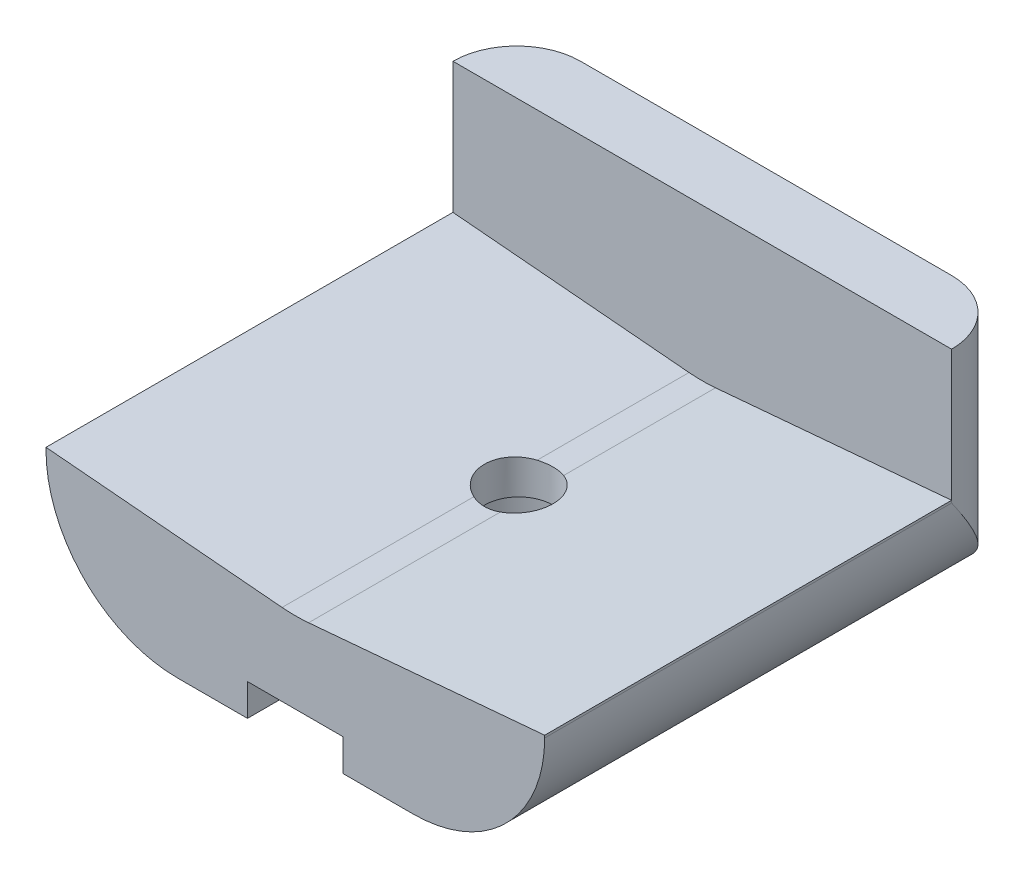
ISO-10303-21;
HEADER;
FILE_DESCRIPTION(('STEP AP214'),'2;1');
FILE_NAME('part.step','',(''),(''),'','','');
FILE_SCHEMA(('AUTOMOTIVE_DESIGN { 1 0 10303 214 1 1 1 1 }'));
ENDSEC;
DATA;
#1=APPLICATION_CONTEXT('core data for automotive mechanical design processes');
#2=APPLICATION_PROTOCOL_DEFINITION('international standard','automotive_design',2000,#1);
#3=PRODUCT_CONTEXT('',#1,'mechanical');
#4=PRODUCT('Part','Part','',(#3));
#5=PRODUCT_RELATED_PRODUCT_CATEGORY('part','',(#4));
#6=PRODUCT_DEFINITION_FORMATION('','',#4);
#7=PRODUCT_DEFINITION_CONTEXT('part definition',#1,'design');
#8=PRODUCT_DEFINITION('design','',#6,#7);
#9=PRODUCT_DEFINITION_SHAPE('','',#8);
#10=(LENGTH_UNIT() NAMED_UNIT(*) SI_UNIT(.MILLI.,.METRE.));
#11=(NAMED_UNIT(*) PLANE_ANGLE_UNIT() SI_UNIT($,.RADIAN.));
#12=(NAMED_UNIT(*) SI_UNIT($,.STERADIAN.) SOLID_ANGLE_UNIT());
#13=UNCERTAINTY_MEASURE_WITH_UNIT(LENGTH_MEASURE(1.E-05),#10,'distance_accuracy_value','');
#14=(GEOMETRIC_REPRESENTATION_CONTEXT(3) GLOBAL_UNCERTAINTY_ASSIGNED_CONTEXT((#13)) GLOBAL_UNIT_ASSIGNED_CONTEXT((#10,
#11,#12)) REPRESENTATION_CONTEXT('',''));
#15=CARTESIAN_POINT('',(0.,0.,0.));
#16=DIRECTION('',(0.,0.,1.));
#17=DIRECTION('',(1.,0.,0.));
#18=AXIS2_PLACEMENT_3D('',#15,#16,#17);
#19=CARTESIAN_POINT('',(15.625,16.6,4.));
#20=DIRECTION('',(0.,0.,1.));
#21=DIRECTION('',(1.,0.,0.));
#22=AXIS2_PLACEMENT_3D('',#19,#20,#21);
#23=CYLINDRICAL_SURFACE('',#22,9.53060500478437);
#24=DIRECTION('',(0.,0.,1.));
#25=VECTOR('',#24,1.);
#26=CARTESIAN_POINT('',(16.4556469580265,7.10566182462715,4.));
#27=LINE('',#26,#25);
#28=CARTESIAN_POINT('',(16.4556469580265,7.10566182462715,17.4830596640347));
#29=VERTEX_POINT('',#28);
#30=CARTESIAN_POINT('',(16.4556469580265,7.10566182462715,29.5));
#31=VERTEX_POINT('',#30);
#32=EDGE_CURVE('E227',#29,#31,#27,.T.);
#33=ORIENTED_EDGE('',*,*,#32,.F.);
#34=CARTESIAN_POINT('',(16.4556469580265,7.10566182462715,17.4830596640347));
#35=CARTESIAN_POINT('',(16.4011559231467,7.10089020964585,17.5058907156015));
#36=CARTESIAN_POINT('',(16.345690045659,7.09651443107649,17.5264772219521));
#37=CARTESIAN_POINT('',(16.233191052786,7.08865446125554,17.5630306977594));
#38=CARTESIAN_POINT('',(16.1761578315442,7.08517033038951,17.5789973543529));
#39=CARTESIAN_POINT('',(16.0609020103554,7.07919361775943,17.6061804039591));
#40=CARTESIAN_POINT('',(16.0026791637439,7.07670124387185,17.6173958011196));
#41=CARTESIAN_POINT('',(15.8854902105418,7.07277469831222,17.6349846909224));
#42=CARTESIAN_POINT('',(15.8265241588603,7.07134044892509,17.6413585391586));
#43=CARTESIAN_POINT('',(15.6490004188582,7.06869347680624,17.6531301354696));
#44=CARTESIAN_POINT('',(15.5298455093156,7.0691380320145,17.6511712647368));
#45=CARTESIAN_POINT('',(15.2937907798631,7.07442103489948,17.6276386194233));
#46=CARTESIAN_POINT('',(15.1768874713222,7.07925201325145,17.6060981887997));
#47=CARTESIAN_POINT('',(15.0170043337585,7.08869640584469,17.5627891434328));
#48=CARTESIAN_POINT('',(14.9716847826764,7.09170716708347,17.5488841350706));
#49=CARTESIAN_POINT('',(14.8821613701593,7.09828279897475,17.5181484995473));
#50=CARTESIAN_POINT('',(14.8379560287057,7.10184688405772,17.5013220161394));
#51=CARTESIAN_POINT('',(14.7943530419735,7.10566182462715,17.4830596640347));
#52=B_SPLINE_CURVE_WITH_KNOTS('',3,(#34,#35,#36,#37,#38,#39,#40,#41,#42,#43,#44,#45,#46,#47,#48,
#49,#50,#51),.UNSPECIFIED.,.F.,.F.,(4,2,2,2,2,2,2,2,4),(0.,0.177766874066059,0.355545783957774,
0.533361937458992,0.711165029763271,1.06685761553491,1.42194565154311,1.56436056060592,
1.70657509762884),.UNSPECIFIED.);
#53=CARTESIAN_POINT('',(14.7943530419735,7.10566182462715,17.4830596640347));
#54=VERTEX_POINT('',#53);
#55=EDGE_CURVE('E306',#29,#54,#52,.T.);
#56=ORIENTED_EDGE('',*,*,#55,.T.);
#57=DIRECTION('',(0.,0.,1.));
#58=VECTOR('',#57,1.);
#59=CARTESIAN_POINT('',(14.7943530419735,7.10566182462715,4.));
#60=LINE('',#59,#58);
#61=CARTESIAN_POINT('',(14.7943530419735,7.10566182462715,29.5));
#62=VERTEX_POINT('',#61);
#63=EDGE_CURVE('E231',#54,#62,#60,.T.);
#64=ORIENTED_EDGE('',*,*,#63,.T.);
#65=CARTESIAN_POINT('',(15.625,16.6,29.5));
#66=DIRECTION('',(0.,0.,1.));
#67=DIRECTION('',(1.,0.,0.));
#68=AXIS2_PLACEMENT_3D('',#65,#66,#67);
#69=CIRCLE('',#68,9.53060500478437);
#70=EDGE_CURVE('E216',#62,#31,#69,.T.);
#71=ORIENTED_EDGE('',*,*,#70,.T.);
#72=EDGE_LOOP('',(#33,#56,#64,#71));
#73=FACE_BOUND('',#72,.T.);
#74=ADVANCED_FACE('F32',(#73),#23,.F.);
#75=CARTESIAN_POINT('',(0.,16.6,59.));
#76=DIRECTION('',(0.,-1.,0.));
#77=DIRECTION('',(0.,0.,-1.));
#78=AXIS2_PLACEMENT_3D('',#75,#76,#77);
#79=PLANE('',#78);
#80=DIRECTION('',(-1.,0.,0.));
#81=VECTOR('',#80,1.);
#82=CARTESIAN_POINT('',(0.,16.6,4.));
#83=LINE('',#82,#81);
#84=CARTESIAN_POINT('',(31.25,16.6,4.));
#85=VERTEX_POINT('',#84);
#86=CARTESIAN_POINT('',(0.,16.6,4.));
#87=VERTEX_POINT('',#86);
#88=EDGE_CURVE('E211',#85,#87,#83,.T.);
#89=ORIENTED_EDGE('',*,*,#88,.F.);
#90=CARTESIAN_POINT('',(27.25,16.6,4.));
#91=DIRECTION('',(0.,-1.,0.));
#92=DIRECTION('',(0.,0.,-1.));
#93=AXIS2_PLACEMENT_3D('',#90,#91,#92);
#94=CIRCLE('',#93,4.);
#95=CARTESIAN_POINT('',(27.25,16.6,0.));
#96=VERTEX_POINT('',#95);
#97=EDGE_CURVE('E384',#85,#96,#94,.F.);
#98=ORIENTED_EDGE('',*,*,#97,.T.);
#99=DIRECTION('',(-1.,0.,0.));
#100=VECTOR('',#99,1.);
#101=CARTESIAN_POINT('',(0.,16.6,0.));
#102=LINE('',#101,#100);
#103=CARTESIAN_POINT('',(4.,16.6,0.));
#104=VERTEX_POINT('',#103);
#105=EDGE_CURVE('E245',#96,#104,#102,.T.);
#106=ORIENTED_EDGE('',*,*,#105,.T.);
#107=CARTESIAN_POINT('',(4.,16.6,4.));
#108=DIRECTION('',(0.,-1.,0.));
#109=DIRECTION('',(0.,0.,-1.));
#110=AXIS2_PLACEMENT_3D('',#107,#108,#109);
#111=CIRCLE('',#110,4.);
#112=EDGE_CURVE('E381',#104,#87,#111,.F.);
#113=ORIENTED_EDGE('',*,*,#112,.T.);
#114=EDGE_LOOP('',(#89,#98,#106,#113));
#115=FACE_BOUND('',#114,.T.);
#116=ADVANCED_FACE('F340',(#115),#79,.F.);
#117=CARTESIAN_POINT('',(0.,0.,59.));
#118=DIRECTION('',(1.,0.,0.));
#119=DIRECTION('',(0.,0.,-1.));
#120=AXIS2_PLACEMENT_3D('',#117,#118,#119);
#121=PLANE('',#120);
#122=DIRECTION('',(0.,-1.,0.));
#123=VECTOR('',#122,1.);
#124=CARTESIAN_POINT('',(0.,8.25,29.5));
#125=LINE('',#124,#123);
#126=CARTESIAN_POINT('',(0.,8.4,29.5));
#127=VERTEX_POINT('',#126);
#128=CARTESIAN_POINT('',(0.,8.25,29.5));
#129=VERTEX_POINT('',#128);
#130=EDGE_CURVE('E243',#127,#129,#125,.T.);
#131=ORIENTED_EDGE('',*,*,#130,.F.);
#132=DIRECTION('',(0.,0.,1.));
#133=VECTOR('',#132,1.);
#134=CARTESIAN_POINT('',(0.,8.4,4.));
#135=LINE('',#134,#133);
#136=CARTESIAN_POINT('',(0.,8.4,4.));
#137=VERTEX_POINT('',#136);
#138=EDGE_CURVE('E213',#137,#127,#135,.T.);
#139=ORIENTED_EDGE('',*,*,#138,.F.);
#140=DIRECTION('',(0.,-1.,0.));
#141=VECTOR('',#140,1.);
#142=CARTESIAN_POINT('',(0.,8.25,4.));
#143=LINE('',#142,#141);
#144=CARTESIAN_POINT('',(0.,8.25,4.));
#145=VERTEX_POINT('',#144);
#146=EDGE_CURVE('E263',#137,#145,#143,.T.);
#147=ORIENTED_EDGE('',*,*,#146,.T.);
#148=DIRECTION('',(0.,0.,-1.));
#149=VECTOR('',#148,1.);
#150=CARTESIAN_POINT('',(0.,8.25,59.));
#151=LINE('',#150,#149);
#152=EDGE_CURVE('E260',#145,#129,#151,.F.);
#153=ORIENTED_EDGE('',*,*,#152,.T.);
#154=EDGE_LOOP('',(#131,#139,#147,#153));
#155=FACE_BOUND('',#154,.T.);
#156=ADVANCED_FACE('F345',(#155),#121,.F.);
#157=CARTESIAN_POINT('',(0.,0.,59.));
#158=DIRECTION('',(0.,1.,0.));
#159=DIRECTION('',(0.,0.,1.));
#160=AXIS2_PLACEMENT_3D('',#157,#158,#159);
#161=PLANE('',#160);
#162=CARTESIAN_POINT('',(15.625,0.,15.5));
#163=DIRECTION('',(0.,-1.,0.));
#164=DIRECTION('',(0.,0.,-1.));
#165=AXIS2_PLACEMENT_3D('',#162,#163,#164);
#166=CIRCLE('',#165,4.);
#167=CARTESIAN_POINT('',(15.625,0.,11.5));
#168=VERTEX_POINT('',#167);
#169=EDGE_CURVE('E184',#168,#168,#166,.T.);
#170=ORIENTED_EDGE('',*,*,#169,.F.);
#171=EDGE_LOOP('',(#170));
#172=FACE_BOUND('',#171,.T.);
#173=CARTESIAN_POINT('',(15.625,0.,23.5));
#174=DIRECTION('',(0.,-1.,0.));
#175=DIRECTION('',(0.,0.,-1.));
#176=AXIS2_PLACEMENT_3D('',#173,#174,#175);
#177=CIRCLE('',#176,3.);
#178=CARTESIAN_POINT('',(12.625,0.,23.5));
#179=VERTEX_POINT('',#178);
#180=CARTESIAN_POINT('',(18.625,0.,23.5));
#181=VERTEX_POINT('',#180);
#182=EDGE_CURVE('E163',#179,#181,#177,.T.);
#183=ORIENTED_EDGE('',*,*,#182,.F.);
#184=DIRECTION('',(0.,0.,-1.));
#185=VECTOR('',#184,1.);
#186=CARTESIAN_POINT('',(12.625,0.,23.5));
#187=LINE('',#186,#185);
#188=CARTESIAN_POINT('',(12.625,0.,29.5));
#189=VERTEX_POINT('',#188);
#190=EDGE_CURVE('E176',#189,#179,#187,.T.);
#191=ORIENTED_EDGE('',*,*,#190,.F.);
#192=DIRECTION('',(1.,0.,0.));
#193=VECTOR('',#192,1.);
#194=CARTESIAN_POINT('',(23.,0.,29.5));
#195=LINE('',#194,#193);
#196=CARTESIAN_POINT('',(8.25,0.,29.5));
#197=VERTEX_POINT('',#196);
#198=EDGE_CURVE('E235',#197,#189,#195,.T.);
#199=ORIENTED_EDGE('',*,*,#198,.F.);
#200=DIRECTION('',(0.,0.,-1.));
#201=VECTOR('',#200,1.);
#202=CARTESIAN_POINT('',(8.25,0.,59.));
#203=LINE('',#202,#201);
#204=CARTESIAN_POINT('',(8.25,0.,1.));
#205=VERTEX_POINT('',#204);
#206=EDGE_CURVE('E255',#197,#205,#203,.T.);
#207=ORIENTED_EDGE('',*,*,#206,.T.);
#208=DIRECTION('',(1.,0.,0.));
#209=VECTOR('',#208,1.);
#210=CARTESIAN_POINT('',(23.,0.,1.));
#211=LINE('',#210,#209);
#212=CARTESIAN_POINT('',(23.,0.,1.));
#213=VERTEX_POINT('',#212);
#214=EDGE_CURVE('E375',#205,#213,#211,.T.);
#215=ORIENTED_EDGE('',*,*,#214,.T.);
#216=DIRECTION('',(0.,0.,-1.));
#217=VECTOR('',#216,1.);
#218=CARTESIAN_POINT('',(23.,0.,59.));
#219=LINE('',#218,#217);
#220=CARTESIAN_POINT('',(23.,0.,29.5));
#221=VERTEX_POINT('',#220);
#222=EDGE_CURVE('E257',#213,#221,#219,.F.);
#223=ORIENTED_EDGE('',*,*,#222,.T.);
#224=CARTESIAN_POINT('',(18.625,0.,29.5));
#225=VERTEX_POINT('',#224);
#226=EDGE_CURVE('E234',#225,#221,#195,.T.);
#227=ORIENTED_EDGE('',*,*,#226,.F.);
#228=DIRECTION('',(0.,0.,1.));
#229=VECTOR('',#228,1.);
#230=CARTESIAN_POINT('',(18.625,0.,23.5));
#231=LINE('',#230,#229);
#232=EDGE_CURVE('E178',#181,#225,#231,.T.);
#233=ORIENTED_EDGE('',*,*,#232,.F.);
#234=EDGE_LOOP('',(#183,#191,#199,#207,#215,#223,#227,#233));
#235=FACE_BOUND('',#234,.T.);
#236=ADVANCED_FACE('F423',(#172,#235),#161,.F.);
#237=CARTESIAN_POINT('',(31.25,0.,59.));
#238=DIRECTION('',(-1.,0.,0.));
#239=DIRECTION('',(0.,0.,1.));
#240=AXIS2_PLACEMENT_3D('',#237,#238,#239);
#241=PLANE('',#240);
#242=DIRECTION('',(0.,1.,0.));
#243=VECTOR('',#242,1.);
#244=CARTESIAN_POINT('',(31.25,16.6,4.));
#245=LINE('',#244,#243);
#246=CARTESIAN_POINT('',(31.25,8.25,4.));
#247=VERTEX_POINT('',#246);
#248=CARTESIAN_POINT('',(31.25,8.4,4.));
#249=VERTEX_POINT('',#248);
#250=EDGE_CURVE('E376',#247,#249,#245,.T.);
#251=ORIENTED_EDGE('',*,*,#250,.T.);
#252=DIRECTION('',(0.,0.,1.));
#253=VECTOR('',#252,1.);
#254=CARTESIAN_POINT('',(31.25,8.4,4.));
#255=LINE('',#254,#253);
#256=CARTESIAN_POINT('',(31.25,8.4,29.5));
#257=VERTEX_POINT('',#256);
#258=EDGE_CURVE('E220',#249,#257,#255,.T.);
#259=ORIENTED_EDGE('',*,*,#258,.T.);
#260=DIRECTION('',(0.,1.,0.));
#261=VECTOR('',#260,1.);
#262=CARTESIAN_POINT('',(31.25,16.6,29.5));
#263=LINE('',#262,#261);
#264=CARTESIAN_POINT('',(31.25,8.25,29.5));
#265=VERTEX_POINT('',#264);
#266=EDGE_CURVE('E240',#265,#257,#263,.T.);
#267=ORIENTED_EDGE('',*,*,#266,.F.);
#268=DIRECTION('',(0.,0.,-1.));
#269=VECTOR('',#268,1.);
#270=CARTESIAN_POINT('',(31.25,8.25,59.));
#271=LINE('',#270,#269);
#272=EDGE_CURVE('E248',#265,#247,#271,.T.);
#273=ORIENTED_EDGE('',*,*,#272,.T.);
#274=EDGE_LOOP('',(#251,#259,#267,#273));
#275=FACE_BOUND('',#274,.T.);
#276=ADVANCED_FACE('F365',(#275),#241,.F.);
#277=CARTESIAN_POINT('',(23.,8.25,59.));
#278=DIRECTION('',(0.,0.,-1.));
#279=DIRECTION('',(-1.,0.,0.));
#280=AXIS2_PLACEMENT_3D('',#277,#278,#279);
#281=CYLINDRICAL_SURFACE('',#280,8.25);
#282=ORIENTED_EDGE('',*,*,#272,.F.);
#283=CARTESIAN_POINT('',(23.,8.25,29.5));
#284=DIRECTION('',(0.,0.,1.));
#285=DIRECTION('',(1.,0.,0.));
#286=AXIS2_PLACEMENT_3D('',#283,#284,#285);
#287=CIRCLE('',#286,8.25);
#288=EDGE_CURVE('E238',#221,#265,#287,.T.);
#289=ORIENTED_EDGE('',*,*,#288,.F.);
#290=ORIENTED_EDGE('',*,*,#222,.F.);
#291=CARTESIAN_POINT('',(26.9370039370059,1.,0.));
#292=CARTESIAN_POINT('',(26.8772664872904,0.967559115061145,9.56359982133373E-06));
#293=CARTESIAN_POINT('',(26.8171466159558,0.935869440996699,0.00157729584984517));
#294=CARTESIAN_POINT('',(26.6962747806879,0.874048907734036,0.00747595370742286));
#295=CARTESIAN_POINT('',(26.6355231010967,0.843917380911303,0.0118056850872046));
#296=CARTESIAN_POINT('',(26.4527147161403,0.756034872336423,0.0283860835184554));
#297=CARTESIAN_POINT('',(26.3298362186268,0.700650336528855,0.0442311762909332));
#298=CARTESIAN_POINT('',(26.0831379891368,0.596594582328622,0.0833011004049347));
#299=CARTESIAN_POINT('',(25.9593248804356,0.547894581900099,0.106492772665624));
#300=CARTESIAN_POINT('',(25.7105214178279,0.456853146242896,0.158723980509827));
#301=CARTESIAN_POINT('',(25.5855302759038,0.414516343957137,0.187767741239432));
#302=CARTESIAN_POINT('',(25.2590313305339,0.312516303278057,0.269353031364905));
#303=CARTESIAN_POINT('',(25.0568571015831,0.257810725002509,0.325499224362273));
#304=CARTESIAN_POINT('',(24.6512544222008,0.164256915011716,0.445627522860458));
#305=CARTESIAN_POINT('',(24.447825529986,0.125414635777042,0.509612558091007));
#306=CARTESIAN_POINT('',(23.8360774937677,0.0321173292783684,0.708917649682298));
#307=CARTESIAN_POINT('',(23.4262197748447,0.000868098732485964,0.851609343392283));
#308=CARTESIAN_POINT('',(23.0114371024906,5.95107002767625E-06,0.996018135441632));
#309=CARTESIAN_POINT('',(23.0057184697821,5.60994147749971E-09,0.998009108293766));
#310=CARTESIAN_POINT('',(23.,0.,1.));
#311=B_SPLINE_CURVE_WITH_KNOTS('',3,(#291,#292,#293,#294,#295,#296,#297,#298,#299,#300,#301,
#302,#303,#304,#305,#306,#307,#308,#309,#310),.UNSPECIFIED.,.F.,.F.,(4,2,2,2,2,2,2,2,2,4),(0.,
0.203874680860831,0.407661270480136,0.814321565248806,1.21917192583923,1.62431563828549,
2.27389857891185,2.92372504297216,4.22312943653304,4.24129534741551),.UNSPECIFIED.);
#312=CARTESIAN_POINT('',(26.9370039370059,1.,0.));
#313=VERTEX_POINT('',#312);
#314=EDGE_CURVE('E429',#213,#313,#311,.F.);
#315=ORIENTED_EDGE('',*,*,#314,.T.);
#316=CARTESIAN_POINT('',(23.,8.25,0.));
#317=DIRECTION('',(0.,0.,-1.));
#318=DIRECTION('',(-1.,0.,0.));
#319=AXIS2_PLACEMENT_3D('',#316,#317,#318);
#320=CIRCLE('',#319,8.25);
#321=CARTESIAN_POINT('',(27.25,1.17893218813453,0.));
#322=VERTEX_POINT('',#321);
#323=EDGE_CURVE('E252',#322,#313,#320,.T.);
#324=ORIENTED_EDGE('',*,*,#323,.F.);
#325=CARTESIAN_POINT('',(27.25,1.17893218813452,0.));
#326=CARTESIAN_POINT('',(27.3239810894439,1.22339514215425,3.75040899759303E-07));
#327=CARTESIAN_POINT('',(27.3972401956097,1.26901041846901,0.00205245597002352));
#328=CARTESIAN_POINT('',(27.5421225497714,1.3623993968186,0.0100216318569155));
#329=CARTESIAN_POINT('',(27.6137463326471,1.4101723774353,0.0159374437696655));
#330=CARTESIAN_POINT('',(27.8255813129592,1.55629979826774,0.0390849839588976));
#331=CARTESIAN_POINT('',(27.9631434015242,1.65769582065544,0.061719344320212));
#332=CARTESIAN_POINT('',(28.2283530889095,1.86604111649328,0.11914757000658));
#333=CARTESIAN_POINT('',(28.3561040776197,1.97290393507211,0.153784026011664));
#334=CARTESIAN_POINT('',(28.6031750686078,2.19242133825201,0.233598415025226));
#335=CARTESIAN_POINT('',(28.7224889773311,2.30508000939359,0.278783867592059));
#336=CARTESIAN_POINT('',(28.9775823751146,2.56050531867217,0.389074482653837));
#337=CARTESIAN_POINT('',(29.1112277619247,2.70445288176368,0.456374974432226));
#338=CARTESIAN_POINT('',(29.3654059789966,2.99815805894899,0.601983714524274));
#339=CARTESIAN_POINT('',(29.4859380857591,3.14791599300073,0.6802925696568));
#340=CARTESIAN_POINT('',(29.714744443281,3.45299405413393,0.846409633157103));
#341=CARTESIAN_POINT('',(29.8229462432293,3.60834064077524,0.934268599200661));
#342=CARTESIAN_POINT('',(30.026659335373,3.92291221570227,1.11747786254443));
#343=CARTESIAN_POINT('',(30.1221668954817,4.08213832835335,1.2128303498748));
#344=CARTESIAN_POINT('',(30.337159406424,4.46905841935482,1.44962770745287));
#345=CARTESIAN_POINT('',(30.4506198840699,4.69828574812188,1.5940590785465));
#346=CARTESIAN_POINT('',(30.6541749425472,5.16129459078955,1.89188672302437));
#347=CARTESIAN_POINT('',(30.7442588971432,5.39507812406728,2.04528703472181));
#348=CARTESIAN_POINT('',(30.9017719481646,5.86548307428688,2.35829207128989));
#349=CARTESIAN_POINT('',(30.9692364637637,6.10209944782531,2.51788665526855));
#350=CARTESIAN_POINT('',(31.0823610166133,6.57740080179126,2.84139838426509));
#351=CARTESIAN_POINT('',(31.1280307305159,6.81608481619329,3.00531357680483));
#352=CARTESIAN_POINT('',(31.1917558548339,7.25153579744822,3.30593946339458));
#353=CARTESIAN_POINT('',(31.2133062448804,7.44809825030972,3.44222439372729));
#354=CARTESIAN_POINT('',(31.2422366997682,7.84148593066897,3.71555444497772));
#355=CARTESIAN_POINT('',(31.2496309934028,8.0383106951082,3.85259866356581));
#356=CARTESIAN_POINT('',(31.2499955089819,8.24006144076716,3.99307967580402));
#357=CARTESIAN_POINT('',(31.249999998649,8.24503073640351,3.99653984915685));
#358=CARTESIAN_POINT('',(31.25,8.25,4.));
#359=B_SPLINE_CURVE_WITH_KNOTS('',3,(#325,#326,#327,#328,#329,#330,#331,#332,#333,#334,#335,
#336,#337,#338,#339,#340,#341,#342,#343,#344,#345,#346,#347,#348,#349,#350,#351,#352,#353,#354,
#355,#356,#357,#358),.UNSPECIFIED.,.F.,.F.,(4,2,2,2,2,2,2,2,2,2,2,2,2,2,2,2,4),(0.,
0.258863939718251,0.517641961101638,1.03384898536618,1.54352722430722,2.05356988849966,
2.67556298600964,3.29759038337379,3.92310236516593,4.54879784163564,5.42871489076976,
6.30903122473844,7.18796258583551,8.06650334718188,8.78658361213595,9.50593971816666,
9.5241056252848),.UNSPECIFIED.);
#360=EDGE_CURVE('E371',#322,#247,#359,.T.);
#361=ORIENTED_EDGE('',*,*,#360,.T.);
#362=EDGE_LOOP('',(#282,#289,#290,#315,#324,#361));
#363=FACE_BOUND('',#362,.T.);
#364=ADVANCED_FACE('F284',(#363),#281,.T.);
#365=CARTESIAN_POINT('',(8.25,8.25,59.));
#366=DIRECTION('',(0.,0.,-1.));
#367=DIRECTION('',(-1.,0.,0.));
#368=AXIS2_PLACEMENT_3D('',#365,#366,#367);
#369=CYLINDRICAL_SURFACE('',#368,8.25);
#370=ORIENTED_EDGE('',*,*,#206,.F.);
#371=CARTESIAN_POINT('',(8.25,8.25,29.5));
#372=DIRECTION('',(0.,0.,1.));
#373=DIRECTION('',(1.,0.,0.));
#374=AXIS2_PLACEMENT_3D('',#371,#372,#373);
#375=CIRCLE('',#374,8.25);
#376=EDGE_CURVE('E223',#129,#197,#375,.T.);
#377=ORIENTED_EDGE('',*,*,#376,.F.);
#378=ORIENTED_EDGE('',*,*,#152,.F.);
#379=CARTESIAN_POINT('',(4.,1.17893218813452,0.));
#380=CARTESIAN_POINT('',(3.92601891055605,1.22339514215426,3.75040900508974E-07));
#381=CARTESIAN_POINT('',(3.8527598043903,1.26901041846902,0.00205245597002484));
#382=CARTESIAN_POINT('',(3.70787745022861,1.36239939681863,0.0100216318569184));
#383=CARTESIAN_POINT('',(3.63625366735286,1.41017237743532,0.0159374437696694));
#384=CARTESIAN_POINT('',(3.4244186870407,1.55629979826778,0.0390849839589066));
#385=CARTESIAN_POINT('',(3.28685659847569,1.6576958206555,0.0617193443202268));
#386=CARTESIAN_POINT('',(3.02164691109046,1.86604111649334,0.119147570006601));
#387=CARTESIAN_POINT('',(2.89389592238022,1.97290393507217,0.153784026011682));
#388=CARTESIAN_POINT('',(2.64682493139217,2.19242133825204,0.233598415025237));
#389=CARTESIAN_POINT('',(2.5275110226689,2.3050800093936,0.278783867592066));
#390=CARTESIAN_POINT('',(2.27241762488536,2.56050531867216,0.389074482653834));
#391=CARTESIAN_POINT('',(2.13877223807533,2.70445288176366,0.456374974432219));
#392=CARTESIAN_POINT('',(1.88459402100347,2.99815805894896,0.601983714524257));
#393=CARTESIAN_POINT('',(1.76406191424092,3.14791599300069,0.680292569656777));
#394=CARTESIAN_POINT('',(1.53525555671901,3.45299405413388,0.846409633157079));
#395=CARTESIAN_POINT('',(1.4270537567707,3.6083406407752,0.934268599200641));
#396=CARTESIAN_POINT('',(1.22334066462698,3.92291221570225,1.11747786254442));
#397=CARTESIAN_POINT('',(1.12783310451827,4.08213832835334,1.2128303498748));
#398=CARTESIAN_POINT('',(0.912840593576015,4.46905841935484,1.44962770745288));
#399=CARTESIAN_POINT('',(0.799380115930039,4.69828574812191,1.59405907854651));
#400=CARTESIAN_POINT('',(0.595825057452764,5.16129459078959,1.89188672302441));
#401=CARTESIAN_POINT('',(0.505741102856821,5.39507812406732,2.04528703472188));
#402=CARTESIAN_POINT('',(0.348228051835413,5.86548307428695,2.3582920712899));
#403=CARTESIAN_POINT('',(0.280763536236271,6.10209944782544,2.51788665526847));
#404=CARTESIAN_POINT('',(0.167638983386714,6.5774008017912,2.84139838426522));
#405=CARTESIAN_POINT('',(0.121969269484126,6.81608481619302,3.00531357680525));
#406=CARTESIAN_POINT('',(0.0582441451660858,7.25153579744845,3.30593946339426));
#407=CARTESIAN_POINT('',(0.0366937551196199,7.44809825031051,3.44222439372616));
#408=CARTESIAN_POINT('',(0.00776330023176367,7.84148593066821,3.71555444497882));
#409=CARTESIAN_POINT('',(0.000369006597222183,8.03831069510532,3.85259866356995));
#410=CARTESIAN_POINT('',(4.49101814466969E-06,8.24006144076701,3.99307967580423));
#411=CARTESIAN_POINT('',(1.35095526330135E-09,8.24503073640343,3.99653984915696));
#412=CARTESIAN_POINT('',(0.,8.25,4.));
#413=B_SPLINE_CURVE_WITH_KNOTS('',3,(#379,#380,#381,#382,#383,#384,#385,#386,#387,#388,#389,
#390,#391,#392,#393,#394,#395,#396,#397,#398,#399,#400,#401,#402,#403,#404,#405,#406,#407,#408,
#409,#410,#411,#412),.UNSPECIFIED.,.F.,.F.,(4,2,2,2,2,2,2,2,2,2,2,2,2,2,2,2,4),(0.,
0.258863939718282,0.5176419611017,1.0338489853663,1.54352722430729,2.05356988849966,
2.6755629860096,3.29759038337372,3.9231023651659,4.54879784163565,5.42871489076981,
6.30903122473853,7.18796258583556,8.06650334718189,8.78658361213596,9.50593971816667,
9.52410562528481),.UNSPECIFIED.);
#414=CARTESIAN_POINT('',(4.,1.17893218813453,0.));
#415=VERTEX_POINT('',#414);
#416=EDGE_CURVE('E267',#145,#415,#413,.F.);
#417=ORIENTED_EDGE('',*,*,#416,.T.);
#418=CARTESIAN_POINT('',(8.25,8.25,0.));
#419=DIRECTION('',(0.,0.,-1.));
#420=DIRECTION('',(-1.,0.,0.));
#421=AXIS2_PLACEMENT_3D('',#418,#419,#420);
#422=CIRCLE('',#421,8.25);
#423=CARTESIAN_POINT('',(4.31299606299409,1.,0.));
#424=VERTEX_POINT('',#423);
#425=EDGE_CURVE('E250',#424,#415,#422,.T.);
#426=ORIENTED_EDGE('',*,*,#425,.F.);
#427=CARTESIAN_POINT('',(4.31299606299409,1.,0.));
#428=CARTESIAN_POINT('',(4.3727335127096,0.967559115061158,9.5635998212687E-06));
#429=CARTESIAN_POINT('',(4.43285338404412,0.935869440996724,0.00157729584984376));
#430=CARTESIAN_POINT('',(4.55372521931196,0.874048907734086,0.00747595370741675));
#431=CARTESIAN_POINT('',(4.61447689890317,0.843917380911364,0.011805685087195));
#432=CARTESIAN_POINT('',(4.79728528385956,0.75603487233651,0.0283860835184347));
#433=CARTESIAN_POINT('',(4.92016378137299,0.700650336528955,0.0442311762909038));
#434=CARTESIAN_POINT('',(5.16686201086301,0.596594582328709,0.0833011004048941));
#435=CARTESIAN_POINT('',(5.29067511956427,0.547894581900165,0.106492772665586));
#436=CARTESIAN_POINT('',(5.53947858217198,0.456853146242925,0.158723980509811));
#437=CARTESIAN_POINT('',(5.66446972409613,0.41451634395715,0.187767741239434));
#438=CARTESIAN_POINT('',(5.99096866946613,0.312516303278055,0.269353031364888));
#439=CARTESIAN_POINT('',(6.19314289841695,0.257810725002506,0.325499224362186));
#440=CARTESIAN_POINT('',(6.59874557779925,0.164256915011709,0.445627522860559));
#441=CARTESIAN_POINT('',(6.80217447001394,0.125414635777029,0.509612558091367));
#442=CARTESIAN_POINT('',(7.41392250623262,0.0321173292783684,0.708917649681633));
#443=CARTESIAN_POINT('',(7.82378022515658,0.000868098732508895,0.851609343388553));
#444=CARTESIAN_POINT('',(8.23856289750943,5.95107002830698E-06,0.996018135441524));
#445=CARTESIAN_POINT('',(8.24428153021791,5.60994179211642E-09,0.998009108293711));
#446=CARTESIAN_POINT('',(8.25,0.,1.));
#447=B_SPLINE_CURVE_WITH_KNOTS('',3,(#427,#428,#429,#430,#431,#432,#433,#434,#435,#436,#437,
#438,#439,#440,#441,#442,#443,#444,#445,#446),.UNSPECIFIED.,.F.,.F.,(4,2,2,2,2,2,2,2,2,4),(0.,
0.203874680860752,0.407661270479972,0.814321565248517,1.2191719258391,1.62431563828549,
2.27389857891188,2.92372504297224,4.22312943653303,4.24129534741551),.UNSPECIFIED.);
#448=EDGE_CURVE('E290',#424,#205,#447,.T.);
#449=ORIENTED_EDGE('',*,*,#448,.T.);
#450=EDGE_LOOP('',(#370,#377,#378,#417,#426,#449));
#451=FACE_BOUND('',#450,.T.);
#452=ADVANCED_FACE('F279',(#451),#369,.T.);
#453=CARTESIAN_POINT('',(0.,16.6,0.));
#454=DIRECTION('',(0.,0.,-1.));
#455=DIRECTION('',(-1.,0.,0.));
#456=AXIS2_PLACEMENT_3D('',#453,#454,#455);
#457=PLANE('',#456);
#458=ORIENTED_EDGE('',*,*,#323,.T.);
#459=DIRECTION('',(1.,0.,0.));
#460=VECTOR('',#459,1.);
#461=CARTESIAN_POINT('',(8.25,1.,0.));
#462=LINE('',#461,#460);
#463=EDGE_CURVE('E298',#313,#424,#462,.F.);
#464=ORIENTED_EDGE('',*,*,#463,.T.);
#465=ORIENTED_EDGE('',*,*,#425,.T.);
#466=DIRECTION('',(0.,-1.,0.));
#467=VECTOR('',#466,1.);
#468=CARTESIAN_POINT('',(4.,16.6,0.));
#469=LINE('',#468,#467);
#470=EDGE_CURVE('E408',#415,#104,#469,.F.);
#471=ORIENTED_EDGE('',*,*,#470,.T.);
#472=ORIENTED_EDGE('',*,*,#105,.F.);
#473=DIRECTION('',(0.,1.,0.));
#474=VECTOR('',#473,1.);
#475=CARTESIAN_POINT('',(27.25,8.25,0.));
#476=LINE('',#475,#474);
#477=EDGE_CURVE('E275',#96,#322,#476,.F.);
#478=ORIENTED_EDGE('',*,*,#477,.T.);
#479=EDGE_LOOP('',(#458,#464,#465,#471,#472,#478));
#480=FACE_BOUND('',#479,.T.);
#481=ADVANCED_FACE('F283',(#480),#457,.T.);
#482=CARTESIAN_POINT('',(4.,0.,4.));
#483=DIRECTION('',(0.,1.,0.));
#484=DIRECTION('',(0.,0.,1.));
#485=AXIS2_PLACEMENT_3D('',#482,#483,#484);
#486=CYLINDRICAL_SURFACE('',#485,4.);
#487=ORIENTED_EDGE('',*,*,#112,.F.);
#488=ORIENTED_EDGE('',*,*,#470,.F.);
#489=ORIENTED_EDGE('',*,*,#416,.F.);
#490=ORIENTED_EDGE('',*,*,#146,.F.);
#491=EDGE_CURVE('E264',#87,#137,#143,.T.);
#492=ORIENTED_EDGE('',*,*,#491,.F.);
#493=EDGE_LOOP('',(#487,#488,#489,#490,#492));
#494=FACE_BOUND('',#493,.T.);
#495=ADVANCED_FACE('F277',(#494),#486,.T.);
#496=CARTESIAN_POINT('',(27.25,0.,4.));
#497=DIRECTION('',(0.,-1.,0.));
#498=DIRECTION('',(0.,0.,-1.));
#499=AXIS2_PLACEMENT_3D('',#496,#497,#498);
#500=CYLINDRICAL_SURFACE('',#499,4.);
#501=ORIENTED_EDGE('',*,*,#360,.F.);
#502=ORIENTED_EDGE('',*,*,#477,.F.);
#503=ORIENTED_EDGE('',*,*,#97,.F.);
#504=DIRECTION('',(0.,1.,0.));
#505=VECTOR('',#504,1.);
#506=CARTESIAN_POINT('',(31.25,16.6,4.));
#507=LINE('',#506,#505);
#508=EDGE_CURVE('E209',#249,#85,#507,.T.);
#509=ORIENTED_EDGE('',*,*,#508,.F.);
#510=ORIENTED_EDGE('',*,*,#250,.F.);
#511=EDGE_LOOP('',(#501,#502,#503,#509,#510));
#512=FACE_BOUND('',#511,.T.);
#513=ADVANCED_FACE('F379',(#512),#500,.T.);
#514=CARTESIAN_POINT('',(0.,1.,1.));
#515=DIRECTION('',(-1.,0.,0.));
#516=DIRECTION('',(0.,0.,1.));
#517=AXIS2_PLACEMENT_3D('',#514,#515,#516);
#518=CYLINDRICAL_SURFACE('',#517,1.);
#519=ORIENTED_EDGE('',*,*,#448,.F.);
#520=ORIENTED_EDGE('',*,*,#463,.F.);
#521=ORIENTED_EDGE('',*,*,#314,.F.);
#522=ORIENTED_EDGE('',*,*,#214,.F.);
#523=EDGE_LOOP('',(#519,#520,#521,#522));
#524=FACE_BOUND('',#523,.T.);
#525=ADVANCED_FACE('F34',(#524),#518,.T.);
#526=CARTESIAN_POINT('',(8.25,8.25,29.5));
#527=DIRECTION('',(0.,0.,1.));
#528=DIRECTION('',(1.,0.,0.));
#529=AXIS2_PLACEMENT_3D('',#526,#527,#528);
#530=PLANE('',#529);
#531=DIRECTION('',(0.,-1.,0.));
#532=VECTOR('',#531,1.);
#533=CARTESIAN_POINT('',(12.625,8.25,29.5));
#534=LINE('',#533,#532);
#535=CARTESIAN_POINT('',(12.625,2.,29.5));
#536=VERTEX_POINT('',#535);
#537=EDGE_CURVE('E11',#536,#189,#534,.T.);
#538=ORIENTED_EDGE('',*,*,#537,.F.);
#539=DIRECTION('',(1.,0.,0.));
#540=VECTOR('',#539,1.);
#541=CARTESIAN_POINT('',(8.25,2.,29.5));
#542=LINE('',#541,#540);
#543=CARTESIAN_POINT('',(18.625,2.,29.5));
#544=VERTEX_POINT('',#543);
#545=EDGE_CURVE('E425',#536,#544,#542,.T.);
#546=ORIENTED_EDGE('',*,*,#545,.T.);
#547=DIRECTION('',(0.,1.,0.));
#548=VECTOR('',#547,1.);
#549=CARTESIAN_POINT('',(18.625,8.25,29.5));
#550=LINE('',#549,#548);
#551=EDGE_CURVE('E41',#225,#544,#550,.T.);
#552=ORIENTED_EDGE('',*,*,#551,.F.);
#553=ORIENTED_EDGE('',*,*,#226,.T.);
#554=ORIENTED_EDGE('',*,*,#288,.T.);
#555=ORIENTED_EDGE('',*,*,#266,.T.);
#556=DIRECTION('',(0.996194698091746,0.0871557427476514,0.));
#557=VECTOR('',#556,1.);
#558=CARTESIAN_POINT('',(31.25,8.4,29.5));
#559=LINE('',#558,#557);
#560=EDGE_CURVE('E203',#31,#257,#559,.T.);
#561=ORIENTED_EDGE('',*,*,#560,.F.);
#562=ORIENTED_EDGE('',*,*,#70,.F.);
#563=DIRECTION('',(0.996194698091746,-0.0871557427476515,0.));
#564=VECTOR('',#563,1.);
#565=CARTESIAN_POINT('',(14.7943530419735,7.10566182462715,29.5));
#566=LINE('',#565,#564);
#567=EDGE_CURVE('E198',#127,#62,#566,.T.);
#568=ORIENTED_EDGE('',*,*,#567,.F.);
#569=ORIENTED_EDGE('',*,*,#130,.T.);
#570=ORIENTED_EDGE('',*,*,#376,.T.);
#571=ORIENTED_EDGE('',*,*,#198,.T.);
#572=EDGE_LOOP('',(#538,#546,#552,#553,#554,#555,#561,#562,#568,#569,#570,#571));
#573=FACE_BOUND('',#572,.T.);
#574=ADVANCED_FACE('F330',(#573),#530,.T.);
#575=CARTESIAN_POINT('',(31.25,8.4,4.));
#576=DIRECTION('',(0.0871557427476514,-0.996194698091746,0.));
#577=DIRECTION('',(0.996194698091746,0.0871557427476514,0.));
#578=AXIS2_PLACEMENT_3D('',#575,#576,#577);
#579=PLANE('',#578);
#580=CARTESIAN_POINT('',(16.4556469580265,7.10566182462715,4.));
#581=VERTEX_POINT('',#580);
#582=CARTESIAN_POINT('',(16.4556469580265,7.10566182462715,13.5169403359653));
#583=VERTEX_POINT('',#582);
#584=EDGE_CURVE('E224',#581,#583,#27,.T.);
#585=ORIENTED_EDGE('',*,*,#584,.T.);
#586=CARTESIAN_POINT('',(15.625,7.03298963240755,15.5));
#587=DIRECTION('',(0.0871557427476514,-0.996194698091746,0.));
#588=DIRECTION('',(-0.996194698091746,-0.0871557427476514,0.));
#589=AXIS2_PLACEMENT_3D('',#586,#587,#588);
#590=ELLIPSE('',#589,2.15821265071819,2.15);
#591=EDGE_CURVE('E56',#583,#29,#590,.T.);
#592=ORIENTED_EDGE('',*,*,#591,.T.);
#593=ORIENTED_EDGE('',*,*,#32,.T.);
#594=ORIENTED_EDGE('',*,*,#560,.T.);
#595=ORIENTED_EDGE('',*,*,#258,.F.);
#596=DIRECTION('',(0.996194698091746,0.0871557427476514,0.));
#597=VECTOR('',#596,1.);
#598=CARTESIAN_POINT('',(31.25,8.4,4.));
#599=LINE('',#598,#597);
#600=EDGE_CURVE('E206',#581,#249,#599,.T.);
#601=ORIENTED_EDGE('',*,*,#600,.F.);
#602=EDGE_LOOP('',(#585,#592,#593,#594,#595,#601));
#603=FACE_BOUND('',#602,.T.);
#604=ADVANCED_FACE('F328',(#603),#579,.F.);
#605=CARTESIAN_POINT('',(14.7943530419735,7.10566182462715,4.));
#606=VERTEX_POINT('',#605);
#607=CARTESIAN_POINT('',(14.7943530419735,7.10566182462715,13.5169403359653));
#608=VERTEX_POINT('',#607);
#609=EDGE_CURVE('E228',#606,#608,#60,.T.);
#610=ORIENTED_EDGE('',*,*,#609,.T.);
#611=CARTESIAN_POINT('',(14.7943530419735,7.10566182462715,13.5169403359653));
#612=CARTESIAN_POINT('',(14.8488440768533,7.10089020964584,13.4941092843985));
#613=CARTESIAN_POINT('',(14.904309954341,7.09651443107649,13.4735227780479));
#614=CARTESIAN_POINT('',(15.016808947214,7.08865446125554,13.4369693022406));
#615=CARTESIAN_POINT('',(15.0738421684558,7.08517033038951,13.4210026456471));
#616=CARTESIAN_POINT('',(15.1890979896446,7.07919361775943,13.3938195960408));
#617=CARTESIAN_POINT('',(15.2473208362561,7.07670124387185,13.3826041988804));
#618=CARTESIAN_POINT('',(15.3645097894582,7.07277469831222,13.3650153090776));
#619=CARTESIAN_POINT('',(15.4234758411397,7.07134044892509,13.3586414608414));
#620=CARTESIAN_POINT('',(15.6009995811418,7.06869347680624,13.3468698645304));
#621=CARTESIAN_POINT('',(15.7201544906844,7.0691380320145,13.3488287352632));
#622=CARTESIAN_POINT('',(15.9562092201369,7.07442103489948,13.3723613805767));
#623=CARTESIAN_POINT('',(16.0731125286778,7.07925201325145,13.3939018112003));
#624=CARTESIAN_POINT('',(16.2329956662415,7.08869640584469,13.4372108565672));
#625=CARTESIAN_POINT('',(16.2783152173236,7.09170716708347,13.4511158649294));
#626=CARTESIAN_POINT('',(16.3678386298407,7.09828279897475,13.4818515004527));
#627=CARTESIAN_POINT('',(16.4120439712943,7.10184688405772,13.4986779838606));
#628=CARTESIAN_POINT('',(16.4556469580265,7.10566182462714,13.5169403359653));
#629=B_SPLINE_CURVE_WITH_KNOTS('',3,(#611,#612,#613,#614,#615,#616,#617,#618,#619,#620,#621,
#622,#623,#624,#625,#626,#627,#628),.UNSPECIFIED.,.F.,.F.,(4,2,2,2,2,2,2,2,4),(0.,
0.177766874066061,0.355545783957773,0.533361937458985,0.711165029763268,1.06685761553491,
1.42194565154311,1.56436056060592,1.70657509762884),.UNSPECIFIED.);
#630=EDGE_CURVE('E297',#608,#583,#629,.T.);
#631=ORIENTED_EDGE('',*,*,#630,.T.);
#632=ORIENTED_EDGE('',*,*,#584,.F.);
#633=CARTESIAN_POINT('',(15.625,16.6,4.));
#634=DIRECTION('',(0.,0.,1.));
#635=DIRECTION('',(1.,0.,0.));
#636=AXIS2_PLACEMENT_3D('',#633,#634,#635);
#637=CIRCLE('',#636,9.53060500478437);
#638=EDGE_CURVE('E202',#606,#581,#637,.T.);
#639=ORIENTED_EDGE('',*,*,#638,.F.);
#640=EDGE_LOOP('',(#610,#631,#632,#639));
#641=FACE_BOUND('',#640,.T.);
#642=ADVANCED_FACE('F311',(#641),#23,.F.);
#643=CARTESIAN_POINT('',(14.7943530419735,7.10566182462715,4.));
#644=DIRECTION('',(-0.0871557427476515,-0.996194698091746,0.));
#645=DIRECTION('',(0.996194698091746,-0.0871557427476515,0.));
#646=AXIS2_PLACEMENT_3D('',#643,#644,#645);
#647=PLANE('',#646);
#648=ORIENTED_EDGE('',*,*,#63,.F.);
#649=CARTESIAN_POINT('',(15.625,7.03298963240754,15.5));
#650=DIRECTION('',(-0.0871557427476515,-0.996194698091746,0.));
#651=DIRECTION('',(0.996194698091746,-0.0871557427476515,0.));
#652=AXIS2_PLACEMENT_3D('',#649,#650,#651);
#653=ELLIPSE('',#652,2.15821265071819,2.15);
#654=EDGE_CURVE('E194',#54,#608,#653,.T.);
#655=ORIENTED_EDGE('',*,*,#654,.T.);
#656=ORIENTED_EDGE('',*,*,#609,.F.);
#657=DIRECTION('',(0.996194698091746,-0.0871557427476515,0.));
#658=VECTOR('',#657,1.);
#659=CARTESIAN_POINT('',(14.7943530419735,7.10566182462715,4.));
#660=LINE('',#659,#658);
#661=EDGE_CURVE('E199',#137,#606,#660,.T.);
#662=ORIENTED_EDGE('',*,*,#661,.F.);
#663=ORIENTED_EDGE('',*,*,#138,.T.);
#664=ORIENTED_EDGE('',*,*,#567,.T.);
#665=EDGE_LOOP('',(#648,#655,#656,#662,#663,#664));
#666=FACE_BOUND('',#665,.T.);
#667=ADVANCED_FACE('F326',(#666),#647,.F.);
#668=CARTESIAN_POINT('',(15.625,16.6,4.));
#669=DIRECTION('',(0.,0.,1.));
#670=DIRECTION('',(1.,0.,0.));
#671=AXIS2_PLACEMENT_3D('',#668,#669,#670);
#672=PLANE('',#671);
#673=ORIENTED_EDGE('',*,*,#491,.T.);
#674=ORIENTED_EDGE('',*,*,#661,.T.);
#675=ORIENTED_EDGE('',*,*,#638,.T.);
#676=ORIENTED_EDGE('',*,*,#600,.T.);
#677=ORIENTED_EDGE('',*,*,#508,.T.);
#678=ORIENTED_EDGE('',*,*,#88,.T.);
#679=EDGE_LOOP('',(#673,#674,#675,#676,#677,#678));
#680=FACE_BOUND('',#679,.T.);
#681=ADVANCED_FACE('F321',(#680),#672,.T.);
#682=CARTESIAN_POINT('',(15.625,0.,15.5));
#683=DIRECTION('',(0.,-1.,0.));
#684=DIRECTION('',(0.,0.,-1.));
#685=AXIS2_PLACEMENT_3D('',#682,#683,#684);
#686=CYLINDRICAL_SURFACE('',#685,2.15);
#687=CARTESIAN_POINT('',(15.625,5.,15.5));
#688=DIRECTION('',(0.,-1.,0.));
#689=DIRECTION('',(0.,0.,-1.));
#690=AXIS2_PLACEMENT_3D('',#687,#688,#689);
#691=CIRCLE('',#690,2.15);
#692=CARTESIAN_POINT('',(15.625,5.,13.35));
#693=VERTEX_POINT('',#692);
#694=EDGE_CURVE('E191',#693,#693,#691,.T.);
#695=ORIENTED_EDGE('',*,*,#694,.T.);
#696=EDGE_LOOP('',(#695));
#697=FACE_BOUND('',#696,.T.);
#698=ORIENTED_EDGE('',*,*,#591,.F.);
#699=ORIENTED_EDGE('',*,*,#630,.F.);
#700=ORIENTED_EDGE('',*,*,#654,.F.);
#701=ORIENTED_EDGE('',*,*,#55,.F.);
#702=EDGE_LOOP('',(#698,#699,#700,#701));
#703=FACE_BOUND('',#702,.T.);
#704=ADVANCED_FACE('F315',(#697,#703),#686,.F.);
#705=CARTESIAN_POINT('',(17.775,5.,15.5));
#706=DIRECTION('',(0.,1.,0.));
#707=DIRECTION('',(0.,0.,1.));
#708=AXIS2_PLACEMENT_3D('',#705,#706,#707);
#709=PLANE('',#708);
#710=ORIENTED_EDGE('',*,*,#694,.F.);
#711=EDGE_LOOP('',(#710));
#712=FACE_BOUND('',#711,.T.);
#713=CARTESIAN_POINT('',(15.625,5.,15.5));
#714=DIRECTION('',(0.,-1.,0.));
#715=DIRECTION('',(0.,0.,-1.));
#716=AXIS2_PLACEMENT_3D('',#713,#714,#715);
#717=CIRCLE('',#716,4.);
#718=CARTESIAN_POINT('',(15.625,5.,11.5));
#719=VERTEX_POINT('',#718);
#720=EDGE_CURVE('E188',#719,#719,#717,.T.);
#721=ORIENTED_EDGE('',*,*,#720,.T.);
#722=EDGE_LOOP('',(#721));
#723=FACE_BOUND('',#722,.T.);
#724=ADVANCED_FACE('F320',(#712,#723),#709,.F.);
#725=CARTESIAN_POINT('',(15.625,0.,15.5));
#726=DIRECTION('',(0.,-1.,0.));
#727=DIRECTION('',(0.,0.,-1.));
#728=AXIS2_PLACEMENT_3D('',#725,#726,#727);
#729=CYLINDRICAL_SURFACE('',#728,4.);
#730=ORIENTED_EDGE('',*,*,#720,.F.);
#731=EDGE_LOOP('',(#730));
#732=FACE_BOUND('',#731,.T.);
#733=ORIENTED_EDGE('',*,*,#169,.T.);
#734=EDGE_LOOP('',(#733));
#735=FACE_BOUND('',#734,.T.);
#736=ADVANCED_FACE('F440',(#732,#735),#729,.F.);
#737=CARTESIAN_POINT('',(15.625,2.,23.5));
#738=DIRECTION('',(0.,-1.,0.));
#739=DIRECTION('',(0.,0.,-1.));
#740=AXIS2_PLACEMENT_3D('',#737,#738,#739);
#741=CYLINDRICAL_SURFACE('',#740,3.);
#742=ORIENTED_EDGE('',*,*,#182,.T.);
#743=DIRECTION('',(0.,-1.,0.));
#744=VECTOR('',#743,1.);
#745=CARTESIAN_POINT('',(18.625,2.,23.5));
#746=LINE('',#745,#744);
#747=CARTESIAN_POINT('',(18.625,2.,23.5));
#748=VERTEX_POINT('',#747);
#749=EDGE_CURVE('E158',#748,#181,#746,.T.);
#750=ORIENTED_EDGE('',*,*,#749,.F.);
#751=CARTESIAN_POINT('',(15.625,2.,23.5));
#752=DIRECTION('',(0.,-1.,0.));
#753=DIRECTION('',(0.,0.,-1.));
#754=AXIS2_PLACEMENT_3D('',#751,#752,#753);
#755=CIRCLE('',#754,3.);
#756=CARTESIAN_POINT('',(12.625,2.,23.5));
#757=VERTEX_POINT('',#756);
#758=EDGE_CURVE('E161',#757,#748,#755,.T.);
#759=ORIENTED_EDGE('',*,*,#758,.F.);
#760=DIRECTION('',(0.,-1.,0.));
#761=VECTOR('',#760,1.);
#762=CARTESIAN_POINT('',(12.625,2.,23.5));
#763=LINE('',#762,#761);
#764=EDGE_CURVE('E166',#757,#179,#763,.T.);
#765=ORIENTED_EDGE('',*,*,#764,.T.);
#766=EDGE_LOOP('',(#742,#750,#759,#765));
#767=FACE_BOUND('',#766,.T.);
#768=ADVANCED_FACE('F159',(#767),#741,.F.);
#769=CARTESIAN_POINT('',(12.625,2.,23.5));
#770=DIRECTION('',(-1.,0.,0.));
#771=DIRECTION('',(0.,0.,1.));
#772=AXIS2_PLACEMENT_3D('',#769,#770,#771);
#773=PLANE('',#772);
#774=ORIENTED_EDGE('',*,*,#537,.T.);
#775=ORIENTED_EDGE('',*,*,#190,.T.);
#776=ORIENTED_EDGE('',*,*,#764,.F.);
#777=DIRECTION('',(0.,0.,-1.));
#778=VECTOR('',#777,1.);
#779=CARTESIAN_POINT('',(12.625,2.,23.5));
#780=LINE('',#779,#778);
#781=EDGE_CURVE('E167',#536,#757,#780,.T.);
#782=ORIENTED_EDGE('',*,*,#781,.F.);
#783=EDGE_LOOP('',(#774,#775,#776,#782));
#784=FACE_BOUND('',#783,.T.);
#785=ADVANCED_FACE('F427',(#784),#773,.F.);
#786=CARTESIAN_POINT('',(18.625,2.,23.5));
#787=DIRECTION('',(1.,0.,0.));
#788=DIRECTION('',(0.,0.,-1.));
#789=AXIS2_PLACEMENT_3D('',#786,#787,#788);
#790=PLANE('',#789);
#791=ORIENTED_EDGE('',*,*,#551,.T.);
#792=DIRECTION('',(0.,0.,1.));
#793=VECTOR('',#792,1.);
#794=CARTESIAN_POINT('',(18.625,2.,23.5));
#795=LINE('',#794,#793);
#796=EDGE_CURVE('E48',#748,#544,#795,.T.);
#797=ORIENTED_EDGE('',*,*,#796,.F.);
#798=ORIENTED_EDGE('',*,*,#749,.T.);
#799=ORIENTED_EDGE('',*,*,#232,.T.);
#800=EDGE_LOOP('',(#791,#797,#798,#799));
#801=FACE_BOUND('',#800,.T.);
#802=ADVANCED_FACE('F169',(#801),#790,.F.);
#803=CARTESIAN_POINT('',(15.625,2.,23.5));
#804=DIRECTION('',(0.,-1.,0.));
#805=DIRECTION('',(0.,0.,-1.));
#806=AXIS2_PLACEMENT_3D('',#803,#804,#805);
#807=PLANE('',#806);
#808=ORIENTED_EDGE('',*,*,#781,.T.);
#809=ORIENTED_EDGE('',*,*,#758,.T.);
#810=ORIENTED_EDGE('',*,*,#796,.T.);
#811=ORIENTED_EDGE('',*,*,#545,.F.);
#812=EDGE_LOOP('',(#808,#809,#810,#811));
#813=FACE_BOUND('',#812,.T.);
#814=ADVANCED_FACE('F173',(#813),#807,.T.);
#815=CLOSED_SHELL('',(#74,#116,#156,#236,#276,#364,#452,#481,#495,#513,#525,#574,#604,#642,#667,
#681,#704,#724,#736,#768,#785,#802,#814));
#816=MANIFOLD_SOLID_BREP('B2',#815);
#817=ADVANCED_BREP_SHAPE_REPRESENTATION('',(#18,#816),#14);
#818=SHAPE_DEFINITION_REPRESENTATION(#9,#817);
ENDSEC;
END-ISO-10303-21;
